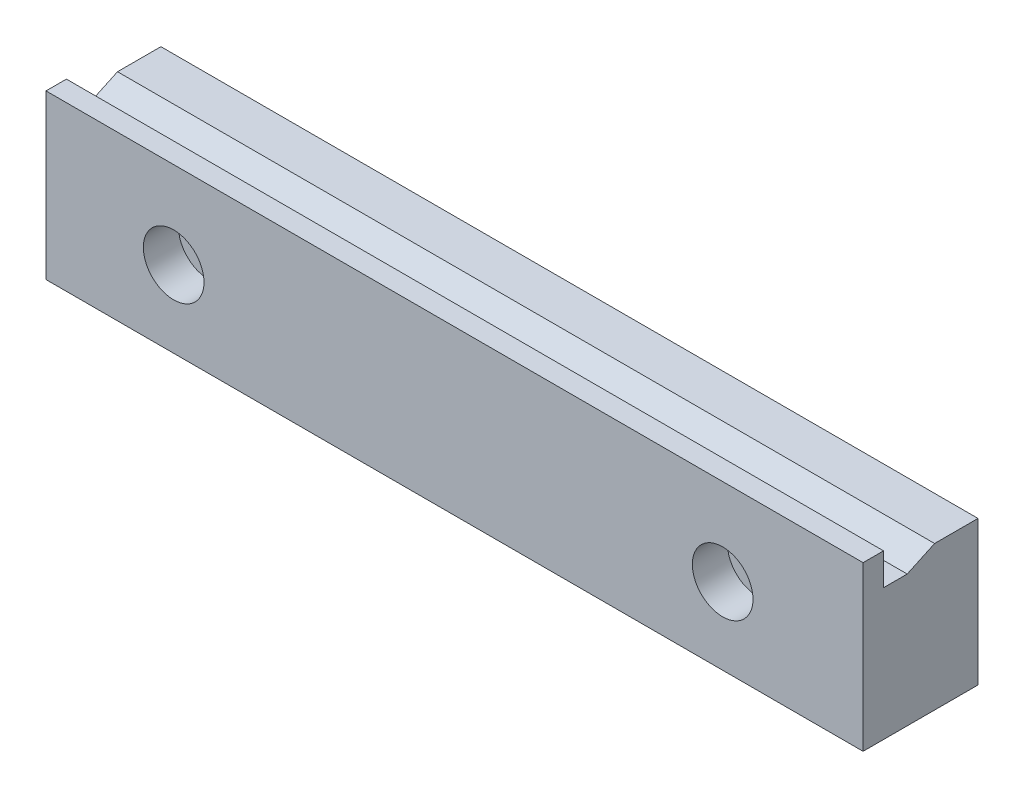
ISO-10303-21;
HEADER;
FILE_DESCRIPTION(('STEP AP214'),'2;1');
FILE_NAME('part.step','',(''),(''),'','','');
FILE_SCHEMA(('AUTOMOTIVE_DESIGN { 1 0 10303 214 1 1 1 1 }'));
ENDSEC;
DATA;
#1=APPLICATION_CONTEXT('core data for automotive mechanical design processes');
#2=APPLICATION_PROTOCOL_DEFINITION('international standard','automotive_design',2000,#1);
#3=PRODUCT_CONTEXT('',#1,'mechanical');
#4=PRODUCT('Part','Part','',(#3));
#5=PRODUCT_RELATED_PRODUCT_CATEGORY('part','',(#4));
#6=PRODUCT_DEFINITION_FORMATION('','',#4);
#7=PRODUCT_DEFINITION_CONTEXT('part definition',#1,'design');
#8=PRODUCT_DEFINITION('design','',#6,#7);
#9=PRODUCT_DEFINITION_SHAPE('','',#8);
#10=(LENGTH_UNIT() NAMED_UNIT(*) SI_UNIT(.MILLI.,.METRE.));
#11=(NAMED_UNIT(*) PLANE_ANGLE_UNIT() SI_UNIT($,.RADIAN.));
#12=(NAMED_UNIT(*) SI_UNIT($,.STERADIAN.) SOLID_ANGLE_UNIT());
#13=UNCERTAINTY_MEASURE_WITH_UNIT(LENGTH_MEASURE(1.E-05),#10,'distance_accuracy_value','');
#14=(GEOMETRIC_REPRESENTATION_CONTEXT(3) GLOBAL_UNCERTAINTY_ASSIGNED_CONTEXT((#13)) GLOBAL_UNIT_ASSIGNED_CONTEXT((#10,
#11,#12)) REPRESENTATION_CONTEXT('',''));
#15=CARTESIAN_POINT('',(0.,0.,0.));
#16=DIRECTION('',(0.,0.,1.));
#17=DIRECTION('',(1.,0.,0.));
#18=AXIS2_PLACEMENT_3D('',#15,#16,#17);
#19=CARTESIAN_POINT('',(0.,25.6,0.));
#20=DIRECTION('',(0.,0.,-1.));
#21=DIRECTION('',(-1.,0.,0.));
#22=AXIS2_PLACEMENT_3D('',#19,#20,#21);
#23=PLANE('',#22);
#24=CARTESIAN_POINT('',(20.,12.,0.));
#25=DIRECTION('',(0.,0.,1.));
#26=DIRECTION('',(1.,0.,0.));
#27=AXIS2_PLACEMENT_3D('',#24,#25,#26);
#28=CIRCLE('',#27,2.75);
#29=CARTESIAN_POINT('',(22.75,12.,0.));
#30=VERTEX_POINT('',#29);
#31=EDGE_CURVE('E133',#30,#30,#28,.T.);
#32=ORIENTED_EDGE('',*,*,#31,.T.);
#33=EDGE_LOOP('',(#32));
#34=FACE_BOUND('',#33,.T.);
#35=CARTESIAN_POINT('',(106.,12.,0.));
#36=DIRECTION('',(0.,0.,1.));
#37=DIRECTION('',(1.,0.,0.));
#38=AXIS2_PLACEMENT_3D('',#35,#36,#37);
#39=CIRCLE('',#38,2.75);
#40=CARTESIAN_POINT('',(108.75,12.,0.));
#41=VERTEX_POINT('',#40);
#42=EDGE_CURVE('E128',#41,#41,#39,.T.);
#43=ORIENTED_EDGE('',*,*,#42,.T.);
#44=EDGE_LOOP('',(#43));
#45=FACE_BOUND('',#44,.T.);
#46=DIRECTION('',(0.,-1.,0.));
#47=VECTOR('',#46,1.);
#48=CARTESIAN_POINT('',(0.,0.,0.));
#49=LINE('',#48,#47);
#50=CARTESIAN_POINT('',(0.,22.6,0.));
#51=VERTEX_POINT('',#50);
#52=CARTESIAN_POINT('',(0.,0.,0.));
#53=VERTEX_POINT('',#52);
#54=EDGE_CURVE('E122',#51,#53,#49,.T.);
#55=ORIENTED_EDGE('',*,*,#54,.F.);
#56=DIRECTION('',(1.,0.,0.));
#57=VECTOR('',#56,1.);
#58=CARTESIAN_POINT('',(0.,22.6,0.));
#59=LINE('',#58,#57);
#60=CARTESIAN_POINT('',(128.,22.6,0.));
#61=VERTEX_POINT('',#60);
#62=EDGE_CURVE('E107',#51,#61,#59,.T.);
#63=ORIENTED_EDGE('',*,*,#62,.T.);
#64=DIRECTION('',(0.,1.,0.));
#65=VECTOR('',#64,1.);
#66=CARTESIAN_POINT('',(128.,0.,0.));
#67=LINE('',#66,#65);
#68=CARTESIAN_POINT('',(128.,0.,0.));
#69=VERTEX_POINT('',#68);
#70=EDGE_CURVE('E130',#69,#61,#67,.T.);
#71=ORIENTED_EDGE('',*,*,#70,.F.);
#72=DIRECTION('',(1.,0.,0.));
#73=VECTOR('',#72,1.);
#74=CARTESIAN_POINT('',(0.,0.,0.));
#75=LINE('',#74,#73);
#76=EDGE_CURVE('E74',#53,#69,#75,.T.);
#77=ORIENTED_EDGE('',*,*,#76,.F.);
#78=EDGE_LOOP('',(#55,#63,#71,#77));
#79=FACE_BOUND('',#78,.T.);
#80=ADVANCED_FACE('F33',(#34,#45,#79),#23,.T.);
#81=CARTESIAN_POINT('',(0.,0.,18.));
#82=DIRECTION('',(1.,0.,0.));
#83=DIRECTION('',(0.,0.,-1.));
#84=AXIS2_PLACEMENT_3D('',#81,#82,#83);
#85=PLANE('',#84);
#86=DIRECTION('',(0.,1.,0.));
#87=VECTOR('',#86,1.);
#88=CARTESIAN_POINT('',(0.,20.6,14.8000000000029));
#89=LINE('',#88,#87);
#90=CARTESIAN_POINT('',(0.,20.6,14.8000000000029));
#91=VERTEX_POINT('',#90);
#92=CARTESIAN_POINT('',(0.,25.6,14.8000000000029));
#93=VERTEX_POINT('',#92);
#94=EDGE_CURVE('E50',#91,#93,#89,.T.);
#95=ORIENTED_EDGE('',*,*,#94,.F.);
#96=DIRECTION('',(0.,0.,1.));
#97=VECTOR('',#96,1.);
#98=CARTESIAN_POINT('',(0.,20.6,14.8000000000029));
#99=LINE('',#98,#97);
#100=CARTESIAN_POINT('',(0.,20.6,11.0890138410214));
#101=VERTEX_POINT('',#100);
#102=EDGE_CURVE('E349',#101,#91,#99,.T.);
#103=ORIENTED_EDGE('',*,*,#102,.F.);
#104=DIRECTION('',(0.,-0.422618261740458,0.906307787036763));
#105=VECTOR('',#104,1.);
#106=CARTESIAN_POINT('',(0.,20.6,11.0890138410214));
#107=LINE('',#106,#105);
#108=CARTESIAN_POINT('',(0.,22.6,6.79999999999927));
#109=VERTEX_POINT('',#108);
#110=EDGE_CURVE('E125',#109,#101,#107,.T.);
#111=ORIENTED_EDGE('',*,*,#110,.F.);
#112=DIRECTION('',(0.,0.,1.));
#113=VECTOR('',#112,1.);
#114=CARTESIAN_POINT('',(0.,22.6,6.79999999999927));
#115=LINE('',#114,#113);
#116=EDGE_CURVE('E110',#51,#109,#115,.T.);
#117=ORIENTED_EDGE('',*,*,#116,.F.);
#118=ORIENTED_EDGE('',*,*,#54,.T.);
#119=DIRECTION('',(0.,0.,-1.));
#120=VECTOR('',#119,1.);
#121=CARTESIAN_POINT('',(0.,0.,18.));
#122=LINE('',#121,#120);
#123=CARTESIAN_POINT('',(0.,0.,18.));
#124=VERTEX_POINT('',#123);
#125=EDGE_CURVE('E12',#124,#53,#122,.T.);
#126=ORIENTED_EDGE('',*,*,#125,.F.);
#127=DIRECTION('',(0.,-1.,0.));
#128=VECTOR('',#127,1.);
#129=CARTESIAN_POINT('',(0.,0.,18.));
#130=LINE('',#129,#128);
#131=CARTESIAN_POINT('',(0.,25.6,18.));
#132=VERTEX_POINT('',#131);
#133=EDGE_CURVE('E139',#132,#124,#130,.T.);
#134=ORIENTED_EDGE('',*,*,#133,.F.);
#135=DIRECTION('',(0.,0.,-1.));
#136=VECTOR('',#135,1.);
#137=CARTESIAN_POINT('',(0.,25.6,18.));
#138=LINE('',#137,#136);
#139=EDGE_CURVE('E140',#132,#93,#138,.T.);
#140=ORIENTED_EDGE('',*,*,#139,.T.);
#141=EDGE_LOOP('',(#95,#103,#111,#117,#118,#126,#134,#140));
#142=FACE_BOUND('',#141,.T.);
#143=ADVANCED_FACE('F35',(#142),#85,.F.);
#144=CARTESIAN_POINT('',(128.,0.,18.));
#145=DIRECTION('',(-1.,0.,0.));
#146=DIRECTION('',(0.,0.,1.));
#147=AXIS2_PLACEMENT_3D('',#144,#145,#146);
#148=PLANE('',#147);
#149=DIRECTION('',(0.,1.,0.));
#150=VECTOR('',#149,1.);
#151=CARTESIAN_POINT('',(128.,20.6,14.8000000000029));
#152=LINE('',#151,#150);
#153=CARTESIAN_POINT('',(128.,20.6,14.8000000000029));
#154=VERTEX_POINT('',#153);
#155=CARTESIAN_POINT('',(128.,25.6,14.8000000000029));
#156=VERTEX_POINT('',#155);
#157=EDGE_CURVE('E126',#154,#156,#152,.T.);
#158=ORIENTED_EDGE('',*,*,#157,.T.);
#159=DIRECTION('',(0.,0.,-1.));
#160=VECTOR('',#159,1.);
#161=CARTESIAN_POINT('',(128.,25.6,18.));
#162=LINE('',#161,#160);
#163=CARTESIAN_POINT('',(128.,25.6,18.));
#164=VERTEX_POINT('',#163);
#165=EDGE_CURVE('E143',#164,#156,#162,.T.);
#166=ORIENTED_EDGE('',*,*,#165,.F.);
#167=DIRECTION('',(0.,1.,0.));
#168=VECTOR('',#167,1.);
#169=CARTESIAN_POINT('',(128.,0.,18.));
#170=LINE('',#169,#168);
#171=CARTESIAN_POINT('',(128.,0.,18.));
#172=VERTEX_POINT('',#171);
#173=EDGE_CURVE('E165',#172,#164,#170,.T.);
#174=ORIENTED_EDGE('',*,*,#173,.F.);
#175=DIRECTION('',(0.,0.,-1.));
#176=VECTOR('',#175,1.);
#177=CARTESIAN_POINT('',(128.,0.,18.));
#178=LINE('',#177,#176);
#179=EDGE_CURVE('E42',#172,#69,#178,.T.);
#180=ORIENTED_EDGE('',*,*,#179,.T.);
#181=ORIENTED_EDGE('',*,*,#70,.T.);
#182=DIRECTION('',(0.,0.,1.));
#183=VECTOR('',#182,1.);
#184=CARTESIAN_POINT('',(128.,22.6,6.79999999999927));
#185=LINE('',#184,#183);
#186=CARTESIAN_POINT('',(128.,22.6,6.79999999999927));
#187=VERTEX_POINT('',#186);
#188=EDGE_CURVE('E113',#61,#187,#185,.T.);
#189=ORIENTED_EDGE('',*,*,#188,.T.);
#190=DIRECTION('',(0.,-0.422618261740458,0.906307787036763));
#191=VECTOR('',#190,1.);
#192=CARTESIAN_POINT('',(128.,20.6,11.0890138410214));
#193=LINE('',#192,#191);
#194=CARTESIAN_POINT('',(128.,20.6,11.0890138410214));
#195=VERTEX_POINT('',#194);
#196=EDGE_CURVE('E320',#187,#195,#193,.T.);
#197=ORIENTED_EDGE('',*,*,#196,.T.);
#198=DIRECTION('',(0.,0.,1.));
#199=VECTOR('',#198,1.);
#200=CARTESIAN_POINT('',(128.,20.6,14.8000000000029));
#201=LINE('',#200,#199);
#202=EDGE_CURVE('E323',#195,#154,#201,.T.);
#203=ORIENTED_EDGE('',*,*,#202,.T.);
#204=EDGE_LOOP('',(#158,#166,#174,#180,#181,#189,#197,#203));
#205=FACE_BOUND('',#204,.T.);
#206=ADVANCED_FACE('F171',(#205),#148,.F.);
#207=CARTESIAN_POINT('',(0.,25.6,18.));
#208=DIRECTION('',(0.,-1.,0.));
#209=DIRECTION('',(0.,0.,-1.));
#210=AXIS2_PLACEMENT_3D('',#207,#208,#209);
#211=PLANE('',#210);
#212=DIRECTION('',(1.,0.,0.));
#213=VECTOR('',#212,1.);
#214=CARTESIAN_POINT('',(0.,25.6,14.8000000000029));
#215=LINE('',#214,#213);
#216=EDGE_CURVE('E177',#93,#156,#215,.T.);
#217=ORIENTED_EDGE('',*,*,#216,.F.);
#218=ORIENTED_EDGE('',*,*,#139,.F.);
#219=DIRECTION('',(-1.,0.,0.));
#220=VECTOR('',#219,1.);
#221=CARTESIAN_POINT('',(0.,25.6,18.));
#222=LINE('',#221,#220);
#223=EDGE_CURVE('E59',#164,#132,#222,.T.);
#224=ORIENTED_EDGE('',*,*,#223,.F.);
#225=ORIENTED_EDGE('',*,*,#165,.T.);
#226=EDGE_LOOP('',(#217,#218,#224,#225));
#227=FACE_BOUND('',#226,.T.);
#228=ADVANCED_FACE('F175',(#227),#211,.F.);
#229=CARTESIAN_POINT('',(20.,12.,18.));
#230=DIRECTION('',(0.,0.,-1.));
#231=DIRECTION('',(-1.,0.,0.));
#232=AXIS2_PLACEMENT_3D('',#229,#230,#231);
#233=CYLINDRICAL_SURFACE('',#232,2.75);
#234=ORIENTED_EDGE('',*,*,#31,.F.);
#235=EDGE_LOOP('',(#234));
#236=FACE_BOUND('',#235,.T.);
#237=CARTESIAN_POINT('',(20.,12.,12.5));
#238=DIRECTION('',(0.,0.,1.));
#239=DIRECTION('',(1.,0.,0.));
#240=AXIS2_PLACEMENT_3D('',#237,#238,#239);
#241=CIRCLE('',#240,2.75);
#242=CARTESIAN_POINT('',(22.75,12.,12.5));
#243=VERTEX_POINT('',#242);
#244=EDGE_CURVE('E37',#243,#243,#241,.T.);
#245=ORIENTED_EDGE('',*,*,#244,.T.);
#246=EDGE_LOOP('',(#245));
#247=FACE_BOUND('',#246,.T.);
#248=ADVANCED_FACE('F202',(#236,#247),#233,.F.);
#249=CARTESIAN_POINT('',(106.,12.,18.));
#250=DIRECTION('',(0.,0.,-1.));
#251=DIRECTION('',(-1.,0.,0.));
#252=AXIS2_PLACEMENT_3D('',#249,#250,#251);
#253=CYLINDRICAL_SURFACE('',#252,2.75);
#254=ORIENTED_EDGE('',*,*,#42,.F.);
#255=EDGE_LOOP('',(#254));
#256=FACE_BOUND('',#255,.T.);
#257=CARTESIAN_POINT('',(106.,12.,12.5));
#258=DIRECTION('',(0.,0.,1.));
#259=DIRECTION('',(1.,0.,0.));
#260=AXIS2_PLACEMENT_3D('',#257,#258,#259);
#261=CIRCLE('',#260,2.75);
#262=CARTESIAN_POINT('',(108.75,12.,12.5));
#263=VERTEX_POINT('',#262);
#264=EDGE_CURVE('E146',#263,#263,#261,.T.);
#265=ORIENTED_EDGE('',*,*,#264,.T.);
#266=EDGE_LOOP('',(#265));
#267=FACE_BOUND('',#266,.T.);
#268=ADVANCED_FACE('F188',(#256,#267),#253,.F.);
#269=CARTESIAN_POINT('',(0.,25.6,18.));
#270=DIRECTION('',(0.,0.,-1.));
#271=DIRECTION('',(-1.,0.,0.));
#272=AXIS2_PLACEMENT_3D('',#269,#270,#271);
#273=PLANE('',#272);
#274=CARTESIAN_POINT('',(20.,12.,18.));
#275=DIRECTION('',(0.,0.,1.));
#276=DIRECTION('',(1.,0.,0.));
#277=AXIS2_PLACEMENT_3D('',#274,#275,#276);
#278=CIRCLE('',#277,4.75);
#279=CARTESIAN_POINT('',(24.75,12.,18.));
#280=VERTEX_POINT('',#279);
#281=EDGE_CURVE('E161',#280,#280,#278,.T.);
#282=ORIENTED_EDGE('',*,*,#281,.F.);
#283=EDGE_LOOP('',(#282));
#284=FACE_BOUND('',#283,.T.);
#285=CARTESIAN_POINT('',(106.,12.,18.));
#286=DIRECTION('',(0.,0.,1.));
#287=DIRECTION('',(1.,0.,0.));
#288=AXIS2_PLACEMENT_3D('',#285,#286,#287);
#289=CIRCLE('',#288,4.75);
#290=CARTESIAN_POINT('',(110.75,12.,18.));
#291=VERTEX_POINT('',#290);
#292=EDGE_CURVE('E154',#291,#291,#289,.T.);
#293=ORIENTED_EDGE('',*,*,#292,.F.);
#294=EDGE_LOOP('',(#293));
#295=FACE_BOUND('',#294,.T.);
#296=ORIENTED_EDGE('',*,*,#133,.T.);
#297=DIRECTION('',(1.,0.,0.));
#298=VECTOR('',#297,1.);
#299=CARTESIAN_POINT('',(0.,0.,18.));
#300=LINE('',#299,#298);
#301=EDGE_CURVE('E79',#124,#172,#300,.T.);
#302=ORIENTED_EDGE('',*,*,#301,.T.);
#303=ORIENTED_EDGE('',*,*,#173,.T.);
#304=ORIENTED_EDGE('',*,*,#223,.T.);
#305=EDGE_LOOP('',(#296,#302,#303,#304));
#306=FACE_BOUND('',#305,.T.);
#307=ADVANCED_FACE('F168',(#284,#295,#306),#273,.F.);
#308=CARTESIAN_POINT('',(0.,0.,18.));
#309=DIRECTION('',(0.,1.,0.));
#310=DIRECTION('',(0.,0.,1.));
#311=AXIS2_PLACEMENT_3D('',#308,#309,#310);
#312=PLANE('',#311);
#313=ORIENTED_EDGE('',*,*,#76,.T.);
#314=ORIENTED_EDGE('',*,*,#179,.F.);
#315=ORIENTED_EDGE('',*,*,#301,.F.);
#316=ORIENTED_EDGE('',*,*,#125,.T.);
#317=EDGE_LOOP('',(#313,#314,#315,#316));
#318=FACE_BOUND('',#317,.T.);
#319=ADVANCED_FACE('F178',(#318),#312,.F.);
#320=CARTESIAN_POINT('',(106.,12.,12.5));
#321=DIRECTION('',(0.,0.,1.));
#322=DIRECTION('',(1.,0.,0.));
#323=AXIS2_PLACEMENT_3D('',#320,#321,#322);
#324=CYLINDRICAL_SURFACE('',#323,4.75);
#325=CARTESIAN_POINT('',(106.,12.,12.5));
#326=DIRECTION('',(0.,0.,1.));
#327=DIRECTION('',(1.,0.,0.));
#328=AXIS2_PLACEMENT_3D('',#325,#326,#327);
#329=CIRCLE('',#328,4.75);
#330=CARTESIAN_POINT('',(110.75,12.,12.5));
#331=VERTEX_POINT('',#330);
#332=EDGE_CURVE('E148',#331,#331,#329,.T.);
#333=ORIENTED_EDGE('',*,*,#332,.F.);
#334=EDGE_LOOP('',(#333));
#335=FACE_BOUND('',#334,.T.);
#336=ORIENTED_EDGE('',*,*,#292,.T.);
#337=EDGE_LOOP('',(#336));
#338=FACE_BOUND('',#337,.T.);
#339=ADVANCED_FACE('F180',(#335,#338),#324,.F.);
#340=CARTESIAN_POINT('',(106.,12.,12.5));
#341=DIRECTION('',(0.,0.,1.));
#342=DIRECTION('',(1.,0.,0.));
#343=AXIS2_PLACEMENT_3D('',#340,#341,#342);
#344=PLANE('',#343);
#345=ORIENTED_EDGE('',*,*,#264,.F.);
#346=EDGE_LOOP('',(#345));
#347=FACE_BOUND('',#346,.T.);
#348=ORIENTED_EDGE('',*,*,#332,.T.);
#349=EDGE_LOOP('',(#348));
#350=FACE_BOUND('',#349,.T.);
#351=ADVANCED_FACE('F185',(#347,#350),#344,.T.);
#352=CARTESIAN_POINT('',(20.,12.,12.5));
#353=DIRECTION('',(0.,0.,1.));
#354=DIRECTION('',(1.,0.,0.));
#355=AXIS2_PLACEMENT_3D('',#352,#353,#354);
#356=CYLINDRICAL_SURFACE('',#355,4.75);
#357=CARTESIAN_POINT('',(20.,12.,12.5));
#358=DIRECTION('',(0.,0.,1.));
#359=DIRECTION('',(1.,0.,0.));
#360=AXIS2_PLACEMENT_3D('',#357,#358,#359);
#361=CIRCLE('',#360,4.75);
#362=CARTESIAN_POINT('',(24.75,12.,12.5));
#363=VERTEX_POINT('',#362);
#364=EDGE_CURVE('E335',#363,#363,#361,.T.);
#365=ORIENTED_EDGE('',*,*,#364,.F.);
#366=EDGE_LOOP('',(#365));
#367=FACE_BOUND('',#366,.T.);
#368=ORIENTED_EDGE('',*,*,#281,.T.);
#369=EDGE_LOOP('',(#368));
#370=FACE_BOUND('',#369,.T.);
#371=ADVANCED_FACE('F246',(#367,#370),#356,.F.);
#372=CARTESIAN_POINT('',(20.,12.,12.5));
#373=DIRECTION('',(0.,0.,1.));
#374=DIRECTION('',(1.,0.,0.));
#375=AXIS2_PLACEMENT_3D('',#372,#373,#374);
#376=PLANE('',#375);
#377=ORIENTED_EDGE('',*,*,#244,.F.);
#378=EDGE_LOOP('',(#377));
#379=FACE_BOUND('',#378,.T.);
#380=ORIENTED_EDGE('',*,*,#364,.T.);
#381=EDGE_LOOP('',(#380));
#382=FACE_BOUND('',#381,.T.);
#383=ADVANCED_FACE('F256',(#379,#382),#376,.T.);
#384=CARTESIAN_POINT('',(0.,20.6,14.8000000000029));
#385=DIRECTION('',(0.,0.,-1.));
#386=DIRECTION('',(-1.,0.,0.));
#387=AXIS2_PLACEMENT_3D('',#384,#385,#386);
#388=PLANE('',#387);
#389=ORIENTED_EDGE('',*,*,#157,.F.);
#390=DIRECTION('',(1.,0.,0.));
#391=VECTOR('',#390,1.);
#392=CARTESIAN_POINT('',(0.,20.6,14.8000000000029));
#393=LINE('',#392,#391);
#394=EDGE_CURVE('E332',#91,#154,#393,.T.);
#395=ORIENTED_EDGE('',*,*,#394,.F.);
#396=ORIENTED_EDGE('',*,*,#94,.T.);
#397=ORIENTED_EDGE('',*,*,#216,.T.);
#398=EDGE_LOOP('',(#389,#395,#396,#397));
#399=FACE_BOUND('',#398,.T.);
#400=ADVANCED_FACE('F265',(#399),#388,.T.);
#401=CARTESIAN_POINT('',(0.,20.6,14.8000000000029));
#402=DIRECTION('',(0.,1.,0.));
#403=DIRECTION('',(0.,0.,1.));
#404=AXIS2_PLACEMENT_3D('',#401,#402,#403);
#405=PLANE('',#404);
#406=ORIENTED_EDGE('',*,*,#202,.F.);
#407=DIRECTION('',(1.,0.,0.));
#408=VECTOR('',#407,1.);
#409=CARTESIAN_POINT('',(0.,20.6,11.0890138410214));
#410=LINE('',#409,#408);
#411=EDGE_CURVE('E321',#101,#195,#410,.T.);
#412=ORIENTED_EDGE('',*,*,#411,.F.);
#413=ORIENTED_EDGE('',*,*,#102,.T.);
#414=ORIENTED_EDGE('',*,*,#394,.T.);
#415=EDGE_LOOP('',(#406,#412,#413,#414));
#416=FACE_BOUND('',#415,.T.);
#417=ADVANCED_FACE('F288',(#416),#405,.T.);
#418=CARTESIAN_POINT('',(0.,20.6,11.0890138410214));
#419=DIRECTION('',(0.,0.906307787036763,0.422618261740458));
#420=DIRECTION('',(0.,-0.422618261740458,0.906307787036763));
#421=AXIS2_PLACEMENT_3D('',#418,#419,#420);
#422=PLANE('',#421);
#423=ORIENTED_EDGE('',*,*,#196,.F.);
#424=DIRECTION('',(1.,0.,0.));
#425=VECTOR('',#424,1.);
#426=CARTESIAN_POINT('',(0.,22.6,6.79999999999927));
#427=LINE('',#426,#425);
#428=EDGE_CURVE('E118',#109,#187,#427,.T.);
#429=ORIENTED_EDGE('',*,*,#428,.F.);
#430=ORIENTED_EDGE('',*,*,#110,.T.);
#431=ORIENTED_EDGE('',*,*,#411,.T.);
#432=EDGE_LOOP('',(#423,#429,#430,#431));
#433=FACE_BOUND('',#432,.T.);
#434=ADVANCED_FACE('F296',(#433),#422,.T.);
#435=CARTESIAN_POINT('',(0.,22.6,6.79999999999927));
#436=DIRECTION('',(0.,1.,0.));
#437=DIRECTION('',(0.,0.,1.));
#438=AXIS2_PLACEMENT_3D('',#435,#436,#437);
#439=PLANE('',#438);
#440=ORIENTED_EDGE('',*,*,#188,.F.);
#441=ORIENTED_EDGE('',*,*,#62,.F.);
#442=ORIENTED_EDGE('',*,*,#116,.T.);
#443=ORIENTED_EDGE('',*,*,#428,.T.);
#444=EDGE_LOOP('',(#440,#441,#442,#443));
#445=FACE_BOUND('',#444,.T.);
#446=ADVANCED_FACE('F109',(#445),#439,.T.);
#447=CLOSED_SHELL('',(#80,#143,#206,#228,#248,#268,#307,#319,#339,#351,#371,#383,#400,#417,#434,#446));
#448=MANIFOLD_SOLID_BREP('B2',#447);
#449=ADVANCED_BREP_SHAPE_REPRESENTATION('',(#18,#448),#14);
#450=SHAPE_DEFINITION_REPRESENTATION(#9,#449);
ENDSEC;
END-ISO-10303-21;
